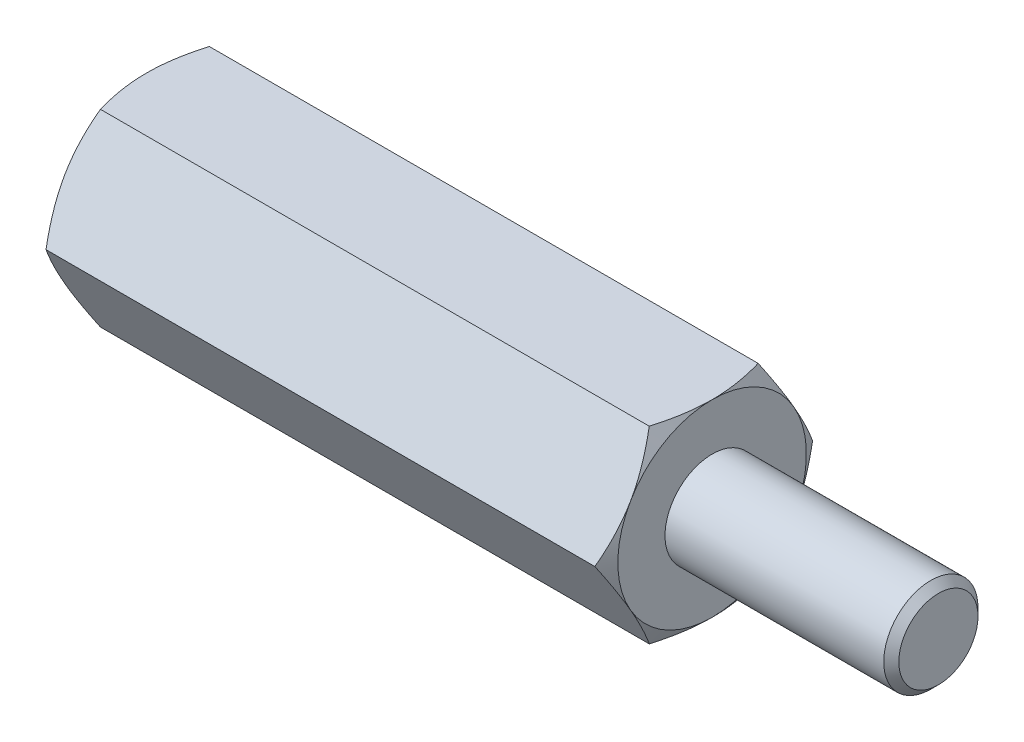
ISO-10303-21;
HEADER;
FILE_DESCRIPTION(('STEP AP214'),'2;1');
FILE_NAME('part.step','',(''),(''),'','','');
FILE_SCHEMA(('AUTOMOTIVE_DESIGN { 1 0 10303 214 1 1 1 1 }'));
ENDSEC;
DATA;
#1=APPLICATION_CONTEXT('core data for automotive mechanical design processes');
#2=APPLICATION_PROTOCOL_DEFINITION('international standard','automotive_design',2000,#1);
#3=PRODUCT_CONTEXT('',#1,'mechanical');
#4=PRODUCT('Part','Part','',(#3));
#5=PRODUCT_RELATED_PRODUCT_CATEGORY('part','',(#4));
#6=PRODUCT_DEFINITION_FORMATION('','',#4);
#7=PRODUCT_DEFINITION_CONTEXT('part definition',#1,'design');
#8=PRODUCT_DEFINITION('design','',#6,#7);
#9=PRODUCT_DEFINITION_SHAPE('','',#8);
#10=(LENGTH_UNIT() NAMED_UNIT(*) SI_UNIT(.MILLI.,.METRE.));
#11=(NAMED_UNIT(*) PLANE_ANGLE_UNIT() SI_UNIT($,.RADIAN.));
#12=(NAMED_UNIT(*) SI_UNIT($,.STERADIAN.) SOLID_ANGLE_UNIT());
#13=UNCERTAINTY_MEASURE_WITH_UNIT(LENGTH_MEASURE(1.E-05),#10,'distance_accuracy_value','');
#14=(GEOMETRIC_REPRESENTATION_CONTEXT(3) GLOBAL_UNCERTAINTY_ASSIGNED_CONTEXT((#13)) GLOBAL_UNIT_ASSIGNED_CONTEXT((#10,
#11,#12)) REPRESENTATION_CONTEXT('',''));
#15=CARTESIAN_POINT('',(0.,0.,0.));
#16=DIRECTION('',(0.,0.,1.));
#17=DIRECTION('',(1.,0.,0.));
#18=AXIS2_PLACEMENT_3D('',#15,#16,#17);
#19=CARTESIAN_POINT('',(7.5,2.5,-1.44337567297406));
#20=DIRECTION('',(1.,0.,0.));
#21=DIRECTION('',(0.,0.,-1.));
#22=AXIS2_PLACEMENT_3D('',#19,#20,#21);
#23=PLANE('',#22);
#24=CARTESIAN_POINT('',(7.5,0.,0.));
#25=DIRECTION('',(1.,0.,0.));
#26=DIRECTION('',(0.,0.,-1.));
#27=AXIS2_PLACEMENT_3D('',#24,#25,#26);
#28=CIRCLE('',#27,2.5);
#29=CARTESIAN_POINT('',(7.5,-1.25,-2.1650635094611));
#30=VERTEX_POINT('',#29);
#31=CARTESIAN_POINT('',(7.5,1.25,-2.1650635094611));
#32=VERTEX_POINT('',#31);
#33=EDGE_CURVE('E288',#30,#32,#28,.T.);
#34=ORIENTED_EDGE('',*,*,#33,.T.);
#35=CARTESIAN_POINT('',(7.5,2.5,0.));
#36=VERTEX_POINT('',#35);
#37=EDGE_CURVE('E53',#32,#36,#28,.T.);
#38=ORIENTED_EDGE('',*,*,#37,.T.);
#39=CARTESIAN_POINT('',(7.5,1.25,2.1650635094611));
#40=VERTEX_POINT('',#39);
#41=EDGE_CURVE('E297',#36,#40,#28,.T.);
#42=ORIENTED_EDGE('',*,*,#41,.T.);
#43=CARTESIAN_POINT('',(7.5,-1.25,2.1650635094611));
#44=VERTEX_POINT('',#43);
#45=EDGE_CURVE('E302',#40,#44,#28,.T.);
#46=ORIENTED_EDGE('',*,*,#45,.T.);
#47=CARTESIAN_POINT('',(7.5,0.,0.));
#48=DIRECTION('',(-1.,0.,0.));
#49=DIRECTION('',(0.,-1.,0.));
#50=AXIS2_PLACEMENT_3D('',#47,#48,#49);
#51=CIRCLE('',#50,2.5);
#52=CARTESIAN_POINT('',(7.5,-2.5,0.));
#53=VERTEX_POINT('',#52);
#54=EDGE_CURVE('E193',#53,#44,#51,.T.);
#55=ORIENTED_EDGE('',*,*,#54,.F.);
#56=EDGE_CURVE('E61',#53,#30,#28,.T.);
#57=ORIENTED_EDGE('',*,*,#56,.T.);
#58=EDGE_LOOP('',(#34,#38,#42,#46,#55,#57));
#59=FACE_BOUND('',#58,.T.);
#60=CARTESIAN_POINT('',(7.5,0.,0.));
#61=DIRECTION('',(1.,0.,0.));
#62=DIRECTION('',(0.,0.,-1.));
#63=AXIS2_PLACEMENT_3D('',#60,#61,#62);
#64=CIRCLE('',#63,1.25);
#65=CARTESIAN_POINT('',(7.5,0.,-1.25));
#66=VERTEX_POINT('',#65);
#67=EDGE_CURVE('E333',#66,#66,#64,.T.);
#68=ORIENTED_EDGE('',*,*,#67,.F.);
#69=EDGE_LOOP('',(#68));
#70=FACE_BOUND('',#69,.T.);
#71=ADVANCED_FACE('F37',(#59,#70),#23,.T.);
#72=CARTESIAN_POINT('',(7.5,0.,-2.88675134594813));
#73=DIRECTION('',(0.,-0.5,0.866025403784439));
#74=DIRECTION('',(0.,-0.866025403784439,-0.5));
#75=AXIS2_PLACEMENT_3D('',#72,#73,#74);
#76=PLANE('',#75);
#77=CARTESIAN_POINT('',(7.27664233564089,-0.000199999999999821,-2.88686681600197));
#78=CARTESIAN_POINT('',(7.31327837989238,0.109663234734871,-2.82343724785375));
#79=CARTESIAN_POINT('',(7.34659778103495,0.220474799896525,-2.75946016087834));
#80=CARTESIAN_POINT('',(7.40475771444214,0.444016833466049,-2.63039810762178));
#81=CARTESIAN_POINT('',(7.42957767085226,0.556751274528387,-2.5653108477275));
#82=CARTESIAN_POINT('',(7.46821434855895,0.780822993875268,-2.43594298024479));
#83=CARTESIAN_POINT('',(7.48228820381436,0.892125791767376,-2.37168227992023));
#84=CARTESIAN_POINT('',(7.49909084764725,1.11525522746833,-2.24285844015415));
#85=CARTESIAN_POINT('',(7.50183354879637,1.22708105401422,-2.17829576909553));
#86=CARTESIAN_POINT('',(7.49613423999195,1.43604197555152,-2.05765212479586));
#87=CARTESIAN_POINT('',(7.48909160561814,1.53320831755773,-2.0015531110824));
#88=CARTESIAN_POINT('',(7.46676858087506,1.726907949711,-1.88972057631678));
#89=CARTESIAN_POINT('',(7.45148056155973,1.82344056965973,-1.8339874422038));
#90=CARTESIAN_POINT('',(7.41326090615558,2.01753972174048,-1.7219242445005));
#91=CARTESIAN_POINT('',(7.39016722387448,2.11508168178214,-1.66560836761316));
#92=CARTESIAN_POINT('',(7.33775334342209,2.30871060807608,-1.55381665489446));
#93=CARTESIAN_POINT('',(7.30844546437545,2.40480005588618,-1.49833938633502));
#94=CARTESIAN_POINT('',(7.27664233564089,2.5002,-1.44326020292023));
#95=B_SPLINE_CURVE_WITH_KNOTS('',3,(#77,#78,#79,#80,#81,#82,#83,#84,#85,#86,#87,#88,#89,#90,#91,
#92,#93,#94),.UNSPECIFIED.,.F.,.F.,(4,2,2,2,2,2,2,2,4),(0.,0.396285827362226,0.79352433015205,
1.18093086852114,1.56786160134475,1.90479741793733,2.24204551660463,2.58677531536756,
2.93082800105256),.UNSPECIFIED.);
#96=CARTESIAN_POINT('',(7.2767090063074,0.,-2.88675134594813));
#97=VERTEX_POINT('',#96);
#98=EDGE_CURVE('E323',#97,#32,#95,.T.);
#99=ORIENTED_EDGE('',*,*,#98,.F.);
#100=DIRECTION('',(-1.,0.,0.));
#101=VECTOR('',#100,1.);
#102=CARTESIAN_POINT('',(7.5,0.,-2.88675134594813));
#103=LINE('',#102,#101);
#104=CARTESIAN_POINT('',(-7.2767090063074,0.,-2.88675134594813));
#105=VERTEX_POINT('',#104);
#106=EDGE_CURVE('E264',#97,#105,#103,.T.);
#107=ORIENTED_EDGE('',*,*,#106,.T.);
#108=CARTESIAN_POINT('',(-7.27664233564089,2.5002,-1.44326020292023));
#109=CARTESIAN_POINT('',(-7.31327837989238,2.39033676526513,-1.50668977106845));
#110=CARTESIAN_POINT('',(-7.34659778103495,2.27952520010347,-1.57066685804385));
#111=CARTESIAN_POINT('',(-7.40475771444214,2.05598316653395,-1.69972891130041));
#112=CARTESIAN_POINT('',(-7.42957767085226,1.94324872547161,-1.7648161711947));
#113=CARTESIAN_POINT('',(-7.46821434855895,1.71917700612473,-1.8941840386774));
#114=CARTESIAN_POINT('',(-7.48228820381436,1.60787420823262,-1.95844473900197));
#115=CARTESIAN_POINT('',(-7.49909084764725,1.38474477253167,-2.08726857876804));
#116=CARTESIAN_POINT('',(-7.50183354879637,1.27291894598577,-2.15183124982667));
#117=CARTESIAN_POINT('',(-7.49613423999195,1.06395802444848,-2.27247489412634));
#118=CARTESIAN_POINT('',(-7.48909160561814,0.96679168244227,-2.32857390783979));
#119=CARTESIAN_POINT('',(-7.46676858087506,0.773092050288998,-2.44040644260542));
#120=CARTESIAN_POINT('',(-7.45148056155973,0.676559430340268,-2.49613957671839));
#121=CARTESIAN_POINT('',(-7.41326090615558,0.482460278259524,-2.60820277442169));
#122=CARTESIAN_POINT('',(-7.39016722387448,0.38491831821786,-2.66451865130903));
#123=CARTESIAN_POINT('',(-7.33775334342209,0.191289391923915,-2.77631036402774));
#124=CARTESIAN_POINT('',(-7.30844546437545,0.0951999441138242,-2.83178763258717));
#125=CARTESIAN_POINT('',(-7.27664233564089,-0.000199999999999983,-2.88686681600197));
#126=B_SPLINE_CURVE_WITH_KNOTS('',3,(#108,#109,#110,#111,#112,#113,#114,#115,#116,#117,#118,
#119,#120,#121,#122,#123,#124,#125),.UNSPECIFIED.,.F.,.F.,(4,2,2,2,2,2,2,2,4),(0.,
0.396285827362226,0.79352433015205,1.18093086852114,1.56786160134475,1.90479741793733,
2.24204551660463,2.58677531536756,2.93082800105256),.UNSPECIFIED.);
#127=CARTESIAN_POINT('',(-7.5,1.25,-2.1650635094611));
#128=VERTEX_POINT('',#127);
#129=EDGE_CURVE('E357',#128,#105,#126,.T.);
#130=ORIENTED_EDGE('',*,*,#129,.F.);
#131=CARTESIAN_POINT('',(-7.2767090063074,2.5,-1.44337567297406));
#132=VERTEX_POINT('',#131);
#133=EDGE_CURVE('E362',#132,#128,#126,.T.);
#134=ORIENTED_EDGE('',*,*,#133,.F.);
#135=DIRECTION('',(-1.,0.,0.));
#136=VECTOR('',#135,1.);
#137=CARTESIAN_POINT('',(7.5,2.5,-1.44337567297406));
#138=LINE('',#137,#136);
#139=CARTESIAN_POINT('',(7.27670900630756,2.5,-1.44337567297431));
#140=VERTEX_POINT('',#139);
#141=EDGE_CURVE('E279',#140,#132,#138,.T.);
#142=ORIENTED_EDGE('',*,*,#141,.F.);
#143=EDGE_CURVE('E229',#32,#140,#95,.T.);
#144=ORIENTED_EDGE('',*,*,#143,.F.);
#145=EDGE_LOOP('',(#99,#107,#130,#134,#142,#144));
#146=FACE_BOUND('',#145,.T.);
#147=ADVANCED_FACE('F148',(#146),#76,.F.);
#148=CARTESIAN_POINT('',(7.5,2.5,-1.44337567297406));
#149=DIRECTION('',(0.,-1.,0.));
#150=DIRECTION('',(0.,0.,-1.));
#151=AXIS2_PLACEMENT_3D('',#148,#149,#150);
#152=PLANE('',#151);
#153=CARTESIAN_POINT('',(6.26803388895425,2.5,-3.90158441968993));
#154=CARTESIAN_POINT('',(6.32120772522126,2.5,-3.79217004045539));
#155=CARTESIAN_POINT('',(6.37387869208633,2.5,-3.68250707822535));
#156=CARTESIAN_POINT('',(6.47793249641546,2.5,-3.46255185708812));
#157=CARTESIAN_POINT('',(6.52931513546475,2.5,-3.35225950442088));
#158=CARTESIAN_POINT('',(6.63076309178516,2.5,-3.130356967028));
#159=CARTESIAN_POINT('',(6.68081992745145,2.5,-3.01874289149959));
#160=CARTESIAN_POINT('',(6.77891712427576,2.5,-2.79463535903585));
#161=CARTESIAN_POINT('',(6.82695757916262,2.5,-2.68214194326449));
#162=CARTESIAN_POINT('',(6.92201845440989,2.5,-2.45240385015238));
#163=CARTESIAN_POINT('',(6.96895431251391,2.5,-2.33512399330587));
#164=CARTESIAN_POINT('',(7.05933269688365,2.5,-2.09920133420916));
#165=CARTESIAN_POINT('',(7.10277483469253,2.5,-1.98055838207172));
#166=CARTESIAN_POINT('',(7.18504351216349,2.5,-1.74193489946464));
#167=CARTESIAN_POINT('',(7.22387917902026,2.5,-1.6219575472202));
#168=CARTESIAN_POINT('',(7.29570507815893,2.5,-1.38028205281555));
#169=CARTESIAN_POINT('',(7.32869712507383,2.5,-1.25858445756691));
#170=CARTESIAN_POINT('',(7.38709594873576,2.5,-1.01406369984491));
#171=CARTESIAN_POINT('',(7.41254379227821,2.5,-0.891250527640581));
#172=CARTESIAN_POINT('',(7.45442751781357,2.5,-0.64407172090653));
#173=CARTESIAN_POINT('',(7.47086432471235,2.5,-0.519706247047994));
#174=CARTESIAN_POINT('',(7.4932006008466,2.5,-0.271679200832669));
#175=CARTESIAN_POINT('',(7.49923751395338,2.5,-0.148030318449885));
#176=CARTESIAN_POINT('',(7.50062561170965,2.5,0.0993395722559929));
#177=CARTESIAN_POINT('',(7.49597656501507,2.5,0.223060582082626));
#178=CARTESIAN_POINT('',(7.47940443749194,2.5,0.432351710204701));
#179=CARTESIAN_POINT('',(7.47010665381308,2.5,0.518143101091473));
#180=CARTESIAN_POINT('',(7.44693847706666,2.5,0.689112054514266));
#181=CARTESIAN_POINT('',(7.43306748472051,2.5,0.774289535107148));
#182=CARTESIAN_POINT('',(7.38532020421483,2.5,1.02876599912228));
#183=CARTESIAN_POINT('',(7.34531764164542,2.5,1.19691958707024));
#184=CARTESIAN_POINT('',(7.25226567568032,2.5,1.53362893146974));
#185=CARTESIAN_POINT('',(7.19893620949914,2.5,1.70210423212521));
#186=CARTESIAN_POINT('',(7.11237169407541,2.5,1.95247339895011));
#187=CARTESIAN_POINT('',(7.08242477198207,2.5,2.03553184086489));
#188=CARTESIAN_POINT('',(7.02068409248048,2.5,2.20095860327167));
#189=CARTESIAN_POINT('',(6.98889037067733,2.5,2.2833269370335));
#190=CARTESIAN_POINT('',(6.90401426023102,2.5,2.49723312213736));
#191=CARTESIAN_POINT('',(6.84971733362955,2.5,2.6282879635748));
#192=CARTESIAN_POINT('',(6.73812739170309,2.5,2.88912034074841));
#193=CARTESIAN_POINT('',(6.6808341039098,2.5,3.01889775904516));
#194=CARTESIAN_POINT('',(6.56393487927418,2.5,3.27745045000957));
#195=CARTESIAN_POINT('',(6.50432825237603,2.5,3.40622540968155));
#196=CARTESIAN_POINT('',(6.38332345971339,2.5,3.66293235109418));
#197=CARTESIAN_POINT('',(6.32192524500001,2.5,3.79086430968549));
#198=CARTESIAN_POINT('',(6.1354580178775,2.5,4.17399495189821));
#199=CARTESIAN_POINT('',(6.00828249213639,2.5,4.42816724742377));
#200=CARTESIAN_POINT('',(5.75034557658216,2.5,4.93461464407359));
#201=CARTESIAN_POINT('',(5.61958483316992,2.5,5.18689007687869));
#202=CARTESIAN_POINT('',(5.36871001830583,2.5,5.66512451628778));
#203=CARTESIAN_POINT('',(5.24882986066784,2.5,5.89120644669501));
#204=CARTESIAN_POINT('',(5.00759021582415,2.5,6.34259369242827));
#205=CARTESIAN_POINT('',(4.88623065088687,2.5,6.56789896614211));
#206=CARTESIAN_POINT('',(4.64278038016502,2.5,7.01722044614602));
#207=CARTESIAN_POINT('',(4.52069305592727,2.5,7.24123848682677));
#208=CARTESIAN_POINT('',(4.27566624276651,2.5,7.68878772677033));
#209=CARTESIAN_POINT('',(4.15272681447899,2.5,7.9123189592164));
#210=CARTESIAN_POINT('',(4.02947566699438,2.5,8.13567697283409));
#211=B_SPLINE_CURVE_WITH_KNOTS('',3,(#153,#154,#155,#156,#157,#158,#159,#160,#161,#162,#163,
#164,#165,#166,#167,#168,#169,#170,#171,#172,#173,#174,#175,#176,#177,#178,#179,#180,#181,#182,
#183,#184,#185,#186,#187,#188,#189,#190,#191,#192,#193,#194,#195,#196,#197,#198,#199,#200,#201,
#202,#203,#204,#205,#206,#207,#208,#209,#210),.UNSPECIFIED.,.F.,.F.,(4,2,2,2,2,2,2,2,2,2,2,2,2,
2,2,2,2,2,2,2,2,2,2,2,2,2,2,2,4),(0.,0.364957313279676,0.729970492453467,1.09692930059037,
1.46387103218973,1.84279746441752,2.22176597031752,2.59997058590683,2.97805755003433,
3.35404692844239,3.72999770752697,4.10094071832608,4.47189175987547,4.73064905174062,
4.98944026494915,5.5072907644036,6.03710483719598,6.30196454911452,6.56681915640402,
6.99233818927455,7.41789598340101,7.84358170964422,8.26927907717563,9.12186602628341,
9.9743002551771,10.7419897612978,11.5097197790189,12.2750964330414,13.0404191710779),.UNSPECIFIED.);
#212=EDGE_CURVE('E227',#140,#36,#211,.T.);
#213=ORIENTED_EDGE('',*,*,#212,.F.);
#214=ORIENTED_EDGE('',*,*,#141,.T.);
#215=CARTESIAN_POINT('',(-6.26803388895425,2.5,-3.90158441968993));
#216=CARTESIAN_POINT('',(-6.32120772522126,2.5,-3.79217004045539));
#217=CARTESIAN_POINT('',(-6.37387869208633,2.5,-3.68250707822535));
#218=CARTESIAN_POINT('',(-6.47793249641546,2.5,-3.46255185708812));
#219=CARTESIAN_POINT('',(-6.52931513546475,2.5,-3.35225950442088));
#220=CARTESIAN_POINT('',(-6.63076309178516,2.5,-3.130356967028));
#221=CARTESIAN_POINT('',(-6.68081992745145,2.5,-3.01874289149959));
#222=CARTESIAN_POINT('',(-6.77891712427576,2.5,-2.79463535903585));
#223=CARTESIAN_POINT('',(-6.82695757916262,2.5,-2.68214194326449));
#224=CARTESIAN_POINT('',(-6.92201845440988,2.5,-2.45240385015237));
#225=CARTESIAN_POINT('',(-6.96895431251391,2.5,-2.33512399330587));
#226=CARTESIAN_POINT('',(-7.05933269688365,2.5,-2.09920133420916));
#227=CARTESIAN_POINT('',(-7.10277483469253,2.5,-1.98055838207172));
#228=CARTESIAN_POINT('',(-7.18504351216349,2.5,-1.74193489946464));
#229=CARTESIAN_POINT('',(-7.22387917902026,2.5,-1.6219575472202));
#230=CARTESIAN_POINT('',(-7.29570507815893,2.5,-1.38028205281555));
#231=CARTESIAN_POINT('',(-7.32869712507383,2.5,-1.25858445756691));
#232=CARTESIAN_POINT('',(-7.38709594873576,2.5,-1.01406369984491));
#233=CARTESIAN_POINT('',(-7.41254379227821,2.5,-0.891250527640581));
#234=CARTESIAN_POINT('',(-7.45442751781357,2.5,-0.64407172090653));
#235=CARTESIAN_POINT('',(-7.47086432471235,2.5,-0.519706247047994));
#236=CARTESIAN_POINT('',(-7.4932006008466,2.5,-0.271679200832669));
#237=CARTESIAN_POINT('',(-7.49923751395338,2.5,-0.148030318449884));
#238=CARTESIAN_POINT('',(-7.50062561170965,2.5,0.0993395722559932));
#239=CARTESIAN_POINT('',(-7.49597656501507,2.5,0.223060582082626));
#240=CARTESIAN_POINT('',(-7.47940443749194,2.5,0.432351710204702));
#241=CARTESIAN_POINT('',(-7.47010665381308,2.5,0.518143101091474));
#242=CARTESIAN_POINT('',(-7.44693847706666,2.5,0.689112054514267));
#243=CARTESIAN_POINT('',(-7.43306748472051,2.5,0.774289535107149));
#244=CARTESIAN_POINT('',(-7.38532020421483,2.5,1.02876599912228));
#245=CARTESIAN_POINT('',(-7.34531764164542,2.5,1.19691958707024));
#246=CARTESIAN_POINT('',(-7.25226567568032,2.5,1.53362893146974));
#247=CARTESIAN_POINT('',(-7.19893620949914,2.5,1.70210423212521));
#248=CARTESIAN_POINT('',(-7.11237169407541,2.5,1.95247339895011));
#249=CARTESIAN_POINT('',(-7.08242477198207,2.5,2.03553184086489));
#250=CARTESIAN_POINT('',(-7.02068409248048,2.5,2.20095860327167));
#251=CARTESIAN_POINT('',(-6.98889037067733,2.5,2.2833269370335));
#252=CARTESIAN_POINT('',(-6.90401426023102,2.5,2.49723312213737));
#253=CARTESIAN_POINT('',(-6.84971733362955,2.5,2.6282879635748));
#254=CARTESIAN_POINT('',(-6.73812739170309,2.5,2.88912034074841));
#255=CARTESIAN_POINT('',(-6.6808341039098,2.5,3.01889775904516));
#256=CARTESIAN_POINT('',(-6.56393487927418,2.5,3.27745045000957));
#257=CARTESIAN_POINT('',(-6.50432825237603,2.5,3.40622540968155));
#258=CARTESIAN_POINT('',(-6.38332345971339,2.5,3.66293235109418));
#259=CARTESIAN_POINT('',(-6.32192524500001,2.5,3.79086430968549));
#260=CARTESIAN_POINT('',(-6.1354580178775,2.5,4.17399495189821));
#261=CARTESIAN_POINT('',(-6.00828249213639,2.5,4.42816724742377));
#262=CARTESIAN_POINT('',(-5.75034557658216,2.5,4.93461464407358));
#263=CARTESIAN_POINT('',(-5.61958483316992,2.5,5.18689007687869));
#264=CARTESIAN_POINT('',(-5.36871001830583,2.5,5.66512451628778));
#265=CARTESIAN_POINT('',(-5.24882986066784,2.5,5.89120644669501));
#266=CARTESIAN_POINT('',(-5.00759021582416,2.5,6.34259369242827));
#267=CARTESIAN_POINT('',(-4.88623065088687,2.5,6.5678989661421));
#268=CARTESIAN_POINT('',(-4.64278038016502,2.5,7.01722044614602));
#269=CARTESIAN_POINT('',(-4.52069305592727,2.5,7.24123848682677));
#270=CARTESIAN_POINT('',(-4.27566624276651,2.5,7.68878772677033));
#271=CARTESIAN_POINT('',(-4.15272681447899,2.5,7.9123189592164));
#272=CARTESIAN_POINT('',(-4.02947566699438,2.5,8.13567697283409));
#273=B_SPLINE_CURVE_WITH_KNOTS('',3,(#215,#216,#217,#218,#219,#220,#221,#222,#223,#224,#225,
#226,#227,#228,#229,#230,#231,#232,#233,#234,#235,#236,#237,#238,#239,#240,#241,#242,#243,#244,
#245,#246,#247,#248,#249,#250,#251,#252,#253,#254,#255,#256,#257,#258,#259,#260,#261,#262,#263,
#264,#265,#266,#267,#268,#269,#270,#271,#272),.UNSPECIFIED.,.F.,.F.,(4,2,2,2,2,2,2,2,2,2,2,2,2,
2,2,2,2,2,2,2,2,2,2,2,2,2,2,2,4),(0.,0.364957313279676,0.729970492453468,1.09692930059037,
1.46387103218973,1.84279746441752,2.22176597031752,2.59997058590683,2.97805755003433,
3.35404692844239,3.72999770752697,4.10094071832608,4.47189175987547,4.73064905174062,
4.98944026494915,5.5072907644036,6.03710483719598,6.30196454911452,6.56681915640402,
6.99233818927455,7.41789598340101,7.84358170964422,8.26927907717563,9.12186602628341,
9.97430025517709,10.7419897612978,11.5097197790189,12.2750964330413,13.0404191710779),.UNSPECIFIED.);
#274=CARTESIAN_POINT('',(-7.5,2.5,0.));
#275=VERTEX_POINT('',#274);
#276=EDGE_CURVE('E241',#275,#132,#273,.F.);
#277=ORIENTED_EDGE('',*,*,#276,.F.);
#278=CARTESIAN_POINT('',(-7.2767090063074,2.5,1.44337567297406));
#279=VERTEX_POINT('',#278);
#280=EDGE_CURVE('E249',#279,#275,#273,.F.);
#281=ORIENTED_EDGE('',*,*,#280,.F.);
#282=DIRECTION('',(-1.,0.,0.));
#283=VECTOR('',#282,1.);
#284=CARTESIAN_POINT('',(7.5,2.5,1.44337567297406));
#285=LINE('',#284,#283);
#286=CARTESIAN_POINT('',(7.2767090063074,2.5,1.44337567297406));
#287=VERTEX_POINT('',#286);
#288=EDGE_CURVE('E276',#287,#279,#285,.T.);
#289=ORIENTED_EDGE('',*,*,#288,.F.);
#290=EDGE_CURVE('E221',#36,#287,#211,.T.);
#291=ORIENTED_EDGE('',*,*,#290,.F.);
#292=EDGE_LOOP('',(#213,#214,#277,#281,#289,#291));
#293=FACE_BOUND('',#292,.T.);
#294=ADVANCED_FACE('F153',(#293),#152,.F.);
#295=CARTESIAN_POINT('',(7.5,2.5,1.44337567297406));
#296=DIRECTION('',(0.,-0.5,-0.866025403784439));
#297=DIRECTION('',(0.,0.866025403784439,-0.5));
#298=AXIS2_PLACEMENT_3D('',#295,#296,#297);
#299=PLANE('',#298);
#300=CARTESIAN_POINT('',(7.27664233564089,2.5002,1.44326020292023));
#301=CARTESIAN_POINT('',(7.31327837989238,2.39033676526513,1.50668977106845));
#302=CARTESIAN_POINT('',(7.34659778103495,2.27952520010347,1.57066685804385));
#303=CARTESIAN_POINT('',(7.40475771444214,2.05598316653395,1.69972891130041));
#304=CARTESIAN_POINT('',(7.42957767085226,1.94324872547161,1.7648161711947));
#305=CARTESIAN_POINT('',(7.46821434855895,1.71917700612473,1.8941840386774));
#306=CARTESIAN_POINT('',(7.48228820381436,1.60787420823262,1.95844473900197));
#307=CARTESIAN_POINT('',(7.49909084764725,1.38474477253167,2.08726857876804));
#308=CARTESIAN_POINT('',(7.50183354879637,1.27291894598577,2.15183124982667));
#309=CARTESIAN_POINT('',(7.49613423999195,1.06395802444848,2.27247489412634));
#310=CARTESIAN_POINT('',(7.48909160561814,0.96679168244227,2.32857390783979));
#311=CARTESIAN_POINT('',(7.46676858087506,0.773092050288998,2.44040644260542));
#312=CARTESIAN_POINT('',(7.45148056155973,0.676559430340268,2.49613957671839));
#313=CARTESIAN_POINT('',(7.41326090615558,0.482460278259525,2.60820277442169));
#314=CARTESIAN_POINT('',(7.39016722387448,0.38491831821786,2.66451865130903));
#315=CARTESIAN_POINT('',(7.33775334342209,0.191289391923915,2.77631036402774));
#316=CARTESIAN_POINT('',(7.30844546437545,0.0951999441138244,2.83178763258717));
#317=CARTESIAN_POINT('',(7.27664233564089,-0.000199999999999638,2.88686681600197));
#318=B_SPLINE_CURVE_WITH_KNOTS('',3,(#300,#301,#302,#303,#304,#305,#306,#307,#308,#309,#310,
#311,#312,#313,#314,#315,#316,#317),.UNSPECIFIED.,.F.,.F.,(4,2,2,2,2,2,2,2,4),(0.,
0.396285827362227,0.79352433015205,1.18093086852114,1.56786160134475,1.90479741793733,
2.24204551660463,2.58677531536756,2.93082800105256),.UNSPECIFIED.);
#319=EDGE_CURVE('E228',#287,#40,#318,.T.);
#320=ORIENTED_EDGE('',*,*,#319,.F.);
#321=ORIENTED_EDGE('',*,*,#288,.T.);
#322=CARTESIAN_POINT('',(-7.27664233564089,-0.000199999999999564,2.88686681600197));
#323=CARTESIAN_POINT('',(-7.31327837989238,0.109663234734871,2.82343724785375));
#324=CARTESIAN_POINT('',(-7.34659778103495,0.220474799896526,2.75946016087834));
#325=CARTESIAN_POINT('',(-7.40475771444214,0.44401683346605,2.63039810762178));
#326=CARTESIAN_POINT('',(-7.42957767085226,0.556751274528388,2.5653108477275));
#327=CARTESIAN_POINT('',(-7.46821434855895,0.780822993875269,2.43594298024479));
#328=CARTESIAN_POINT('',(-7.48228820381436,0.892125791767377,2.37168227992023));
#329=CARTESIAN_POINT('',(-7.49909084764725,1.11525522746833,2.24285844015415));
#330=CARTESIAN_POINT('',(-7.50183354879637,1.22708105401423,2.17829576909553));
#331=CARTESIAN_POINT('',(-7.49613423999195,1.43604197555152,2.05765212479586));
#332=CARTESIAN_POINT('',(-7.48909160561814,1.53320831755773,2.0015531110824));
#333=CARTESIAN_POINT('',(-7.46676858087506,1.726907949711,1.88972057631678));
#334=CARTESIAN_POINT('',(-7.45148056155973,1.82344056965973,1.8339874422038));
#335=CARTESIAN_POINT('',(-7.41326090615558,2.01753972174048,1.7219242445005));
#336=CARTESIAN_POINT('',(-7.39016722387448,2.11508168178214,1.66560836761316));
#337=CARTESIAN_POINT('',(-7.33775334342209,2.30871060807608,1.55381665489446));
#338=CARTESIAN_POINT('',(-7.30844546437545,2.40480005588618,1.49833938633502));
#339=CARTESIAN_POINT('',(-7.27664233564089,2.5002,1.44326020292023));
#340=B_SPLINE_CURVE_WITH_KNOTS('',3,(#322,#323,#324,#325,#326,#327,#328,#329,#330,#331,#332,
#333,#334,#335,#336,#337,#338,#339),.UNSPECIFIED.,.F.,.F.,(4,2,2,2,2,2,2,2,4),(0.,
0.396285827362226,0.79352433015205,1.18093086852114,1.56786160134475,1.90479741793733,
2.24204551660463,2.58677531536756,2.93082800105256),.UNSPECIFIED.);
#341=CARTESIAN_POINT('',(-7.5,1.25,2.1650635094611));
#342=VERTEX_POINT('',#341);
#343=EDGE_CURVE('E255',#342,#279,#340,.T.);
#344=ORIENTED_EDGE('',*,*,#343,.F.);
#345=CARTESIAN_POINT('',(-7.2767090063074,0.,2.88675134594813));
#346=VERTEX_POINT('',#345);
#347=EDGE_CURVE('E262',#346,#342,#340,.T.);
#348=ORIENTED_EDGE('',*,*,#347,.F.);
#349=DIRECTION('',(-1.,0.,0.));
#350=VECTOR('',#349,1.);
#351=CARTESIAN_POINT('',(7.5,0.,2.88675134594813));
#352=LINE('',#351,#350);
#353=CARTESIAN_POINT('',(7.2767090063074,0.,2.88675134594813));
#354=VERTEX_POINT('',#353);
#355=EDGE_CURVE('E273',#354,#346,#352,.T.);
#356=ORIENTED_EDGE('',*,*,#355,.F.);
#357=EDGE_CURVE('E215',#40,#354,#318,.T.);
#358=ORIENTED_EDGE('',*,*,#357,.F.);
#359=EDGE_LOOP('',(#320,#321,#344,#348,#356,#358));
#360=FACE_BOUND('',#359,.T.);
#361=ADVANCED_FACE('F235',(#360),#299,.F.);
#362=CARTESIAN_POINT('',(7.5,0.,2.88675134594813));
#363=DIRECTION('',(0.,0.5,-0.866025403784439));
#364=DIRECTION('',(0.,0.866025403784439,0.5));
#365=AXIS2_PLACEMENT_3D('',#362,#363,#364);
#366=PLANE('',#365);
#367=CARTESIAN_POINT('',(7.27664233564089,0.000200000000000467,2.88686681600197));
#368=CARTESIAN_POINT('',(7.31327837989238,-0.109663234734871,2.82343724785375));
#369=CARTESIAN_POINT('',(7.34659778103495,-0.220474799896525,2.75946016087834));
#370=CARTESIAN_POINT('',(7.40475771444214,-0.444016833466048,2.63039810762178));
#371=CARTESIAN_POINT('',(7.42957767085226,-0.556751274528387,2.5653108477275));
#372=CARTESIAN_POINT('',(7.46821434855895,-0.780822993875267,2.43594298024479));
#373=CARTESIAN_POINT('',(7.48228820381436,-0.892125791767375,2.37168227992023));
#374=CARTESIAN_POINT('',(7.49909084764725,-1.11525522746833,2.24285844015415));
#375=CARTESIAN_POINT('',(7.50183354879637,-1.22708105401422,2.17829576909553));
#376=CARTESIAN_POINT('',(7.49613423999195,-1.43604197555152,2.05765212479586));
#377=CARTESIAN_POINT('',(7.48909160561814,-1.53320831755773,2.0015531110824));
#378=CARTESIAN_POINT('',(7.46676858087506,-1.726907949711,1.88972057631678));
#379=CARTESIAN_POINT('',(7.45148056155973,-1.82344056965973,1.8339874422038));
#380=CARTESIAN_POINT('',(7.41326090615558,-2.01753972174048,1.7219242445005));
#381=CARTESIAN_POINT('',(7.39016722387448,-2.11508168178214,1.66560836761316));
#382=CARTESIAN_POINT('',(7.33775334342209,-2.30871060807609,1.55381665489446));
#383=CARTESIAN_POINT('',(7.30844546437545,-2.40480005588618,1.49833938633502));
#384=CARTESIAN_POINT('',(7.27664233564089,-2.5002,1.44326020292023));
#385=B_SPLINE_CURVE_WITH_KNOTS('',3,(#367,#368,#369,#370,#371,#372,#373,#374,#375,#376,#377,
#378,#379,#380,#381,#382,#383,#384),.UNSPECIFIED.,.F.,.F.,(4,2,2,2,2,2,2,2,4),(0.,
0.396285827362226,0.793524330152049,1.18093086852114,1.56786160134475,1.90479741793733,
2.24204551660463,2.58677531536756,2.93082800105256),.UNSPECIFIED.);
#386=EDGE_CURVE('E410',#354,#44,#385,.T.);
#387=ORIENTED_EDGE('',*,*,#386,.F.);
#388=ORIENTED_EDGE('',*,*,#355,.T.);
#389=CARTESIAN_POINT('',(-7.27664233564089,-2.5002,1.44326020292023));
#390=CARTESIAN_POINT('',(-7.31327837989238,-2.39033676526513,1.50668977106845));
#391=CARTESIAN_POINT('',(-7.34659778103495,-2.27952520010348,1.57066685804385));
#392=CARTESIAN_POINT('',(-7.40475771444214,-2.05598316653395,1.69972891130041));
#393=CARTESIAN_POINT('',(-7.42957767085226,-1.94324872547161,1.7648161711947));
#394=CARTESIAN_POINT('',(-7.46821434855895,-1.71917700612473,1.8941840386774));
#395=CARTESIAN_POINT('',(-7.48228820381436,-1.60787420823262,1.95844473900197));
#396=CARTESIAN_POINT('',(-7.49909084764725,-1.38474477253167,2.08726857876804));
#397=CARTESIAN_POINT('',(-7.50183354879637,-1.27291894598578,2.15183124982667));
#398=CARTESIAN_POINT('',(-7.49613423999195,-1.06395802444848,2.27247489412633));
#399=CARTESIAN_POINT('',(-7.48909160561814,-0.966791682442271,2.32857390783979));
#400=CARTESIAN_POINT('',(-7.46676858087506,-0.773092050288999,2.44040644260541));
#401=CARTESIAN_POINT('',(-7.45148056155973,-0.676559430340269,2.49613957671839));
#402=CARTESIAN_POINT('',(-7.41326090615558,-0.482460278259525,2.60820277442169));
#403=CARTESIAN_POINT('',(-7.39016722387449,-0.38491831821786,2.66451865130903));
#404=CARTESIAN_POINT('',(-7.33775334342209,-0.191289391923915,2.77631036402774));
#405=CARTESIAN_POINT('',(-7.30844546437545,-0.0951999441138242,2.83178763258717));
#406=CARTESIAN_POINT('',(-7.27664233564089,0.000200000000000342,2.88686681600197));
#407=B_SPLINE_CURVE_WITH_KNOTS('',3,(#389,#390,#391,#392,#393,#394,#395,#396,#397,#398,#399,
#400,#401,#402,#403,#404,#405,#406),.UNSPECIFIED.,.F.,.F.,(4,2,2,2,2,2,2,2,4),(0.,
0.396285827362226,0.793524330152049,1.18093086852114,1.56786160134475,1.90479741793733,
2.24204551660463,2.58677531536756,2.93082800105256),.UNSPECIFIED.);
#408=CARTESIAN_POINT('',(-7.5,-1.25,2.1650635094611));
#409=VERTEX_POINT('',#408);
#410=EDGE_CURVE('E263',#409,#346,#407,.T.);
#411=ORIENTED_EDGE('',*,*,#410,.F.);
#412=CARTESIAN_POINT('',(-7.2767090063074,-2.5,1.44337567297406));
#413=VERTEX_POINT('',#412);
#414=EDGE_CURVE('E250',#413,#409,#407,.T.);
#415=ORIENTED_EDGE('',*,*,#414,.F.);
#416=DIRECTION('',(-1.,0.,0.));
#417=VECTOR('',#416,1.);
#418=CARTESIAN_POINT('',(7.5,-2.5,1.44337567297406));
#419=LINE('',#418,#417);
#420=CARTESIAN_POINT('',(7.2767090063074,-2.5,1.44337567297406));
#421=VERTEX_POINT('',#420);
#422=EDGE_CURVE('E270',#421,#413,#419,.T.);
#423=ORIENTED_EDGE('',*,*,#422,.F.);
#424=EDGE_CURVE('E210',#44,#421,#385,.T.);
#425=ORIENTED_EDGE('',*,*,#424,.F.);
#426=EDGE_LOOP('',(#387,#388,#411,#415,#423,#425));
#427=FACE_BOUND('',#426,.T.);
#428=ADVANCED_FACE('F393',(#427),#366,.F.);
#429=CARTESIAN_POINT('',(7.5,-2.5,1.44337567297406));
#430=DIRECTION('',(0.,1.,0.));
#431=DIRECTION('',(0.,0.,1.));
#432=AXIS2_PLACEMENT_3D('',#429,#430,#431);
#433=PLANE('',#432);
#434=CARTESIAN_POINT('',(6.26803388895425,-2.5,-3.90158441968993));
#435=CARTESIAN_POINT('',(6.32120772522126,-2.5,-3.79217004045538));
#436=CARTESIAN_POINT('',(6.37387869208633,-2.5,-3.68250707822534));
#437=CARTESIAN_POINT('',(6.47793249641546,-2.5,-3.46255185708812));
#438=CARTESIAN_POINT('',(6.52931513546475,-2.5,-3.35225950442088));
#439=CARTESIAN_POINT('',(6.63076309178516,-2.5,-3.130356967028));
#440=CARTESIAN_POINT('',(6.68081992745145,-2.5,-3.01874289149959));
#441=CARTESIAN_POINT('',(6.77891712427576,-2.5,-2.79463535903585));
#442=CARTESIAN_POINT('',(6.82695757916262,-2.5,-2.68214194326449));
#443=CARTESIAN_POINT('',(6.92201845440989,-2.5,-2.45240385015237));
#444=CARTESIAN_POINT('',(6.96895431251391,-2.5,-2.33512399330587));
#445=CARTESIAN_POINT('',(7.05933269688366,-2.5,-2.09920133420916));
#446=CARTESIAN_POINT('',(7.10277483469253,-2.5,-1.98055838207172));
#447=CARTESIAN_POINT('',(7.18504351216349,-2.5,-1.74193489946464));
#448=CARTESIAN_POINT('',(7.22387917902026,-2.5,-1.6219575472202));
#449=CARTESIAN_POINT('',(7.29570507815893,-2.5,-1.38028205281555));
#450=CARTESIAN_POINT('',(7.32869712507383,-2.5,-1.25858445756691));
#451=CARTESIAN_POINT('',(7.38709594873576,-2.5,-1.01406369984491));
#452=CARTESIAN_POINT('',(7.41254379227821,-2.5,-0.891250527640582));
#453=CARTESIAN_POINT('',(7.45442751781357,-2.5,-0.644071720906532));
#454=CARTESIAN_POINT('',(7.47086432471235,-2.5,-0.519706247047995));
#455=CARTESIAN_POINT('',(7.4932006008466,-2.5,-0.27167920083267));
#456=CARTESIAN_POINT('',(7.49923751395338,-2.5,-0.148030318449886));
#457=CARTESIAN_POINT('',(7.50062561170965,-2.5,0.0993395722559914));
#458=CARTESIAN_POINT('',(7.49597656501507,-2.5,0.223060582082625));
#459=CARTESIAN_POINT('',(7.47940443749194,-2.5,0.432351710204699));
#460=CARTESIAN_POINT('',(7.47010665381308,-2.5,0.518143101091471));
#461=CARTESIAN_POINT('',(7.44693847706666,-2.5,0.689112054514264));
#462=CARTESIAN_POINT('',(7.43306748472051,-2.5,0.774289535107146));
#463=CARTESIAN_POINT('',(7.38532020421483,-2.5,1.02876599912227));
#464=CARTESIAN_POINT('',(7.34531764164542,-2.5,1.19691958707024));
#465=CARTESIAN_POINT('',(7.25226567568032,-2.5,1.53362893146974));
#466=CARTESIAN_POINT('',(7.19893620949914,-2.5,1.70210423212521));
#467=CARTESIAN_POINT('',(7.11237169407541,-2.5,1.95247339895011));
#468=CARTESIAN_POINT('',(7.08242477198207,-2.5,2.03553184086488));
#469=CARTESIAN_POINT('',(7.02068409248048,-2.5,2.20095860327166));
#470=CARTESIAN_POINT('',(6.98889037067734,-2.5,2.28332693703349));
#471=CARTESIAN_POINT('',(6.90401426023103,-2.5,2.49723312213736));
#472=CARTESIAN_POINT('',(6.84971733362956,-2.5,2.6282879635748));
#473=CARTESIAN_POINT('',(6.7381273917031,-2.5,2.8891203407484));
#474=CARTESIAN_POINT('',(6.6808341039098,-2.5,3.01889775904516));
#475=CARTESIAN_POINT('',(6.56393487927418,-2.5,3.27745045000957));
#476=CARTESIAN_POINT('',(6.50432825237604,-2.5,3.40622540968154));
#477=CARTESIAN_POINT('',(6.3833234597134,-2.5,3.66293235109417));
#478=CARTESIAN_POINT('',(6.32192524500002,-2.5,3.79086430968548));
#479=CARTESIAN_POINT('',(6.1354580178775,-2.5,4.1739949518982));
#480=CARTESIAN_POINT('',(6.00828249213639,-2.5,4.42816724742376));
#481=CARTESIAN_POINT('',(5.75034557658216,-2.5,4.93461464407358));
#482=CARTESIAN_POINT('',(5.61958483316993,-2.5,5.18689007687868));
#483=CARTESIAN_POINT('',(5.36871001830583,-2.5,5.66512451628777));
#484=CARTESIAN_POINT('',(5.24882986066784,-2.5,5.891206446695));
#485=CARTESIAN_POINT('',(5.00759021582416,-2.5,6.34259369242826));
#486=CARTESIAN_POINT('',(4.88623065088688,-2.5,6.5678989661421));
#487=CARTESIAN_POINT('',(4.64278038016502,-2.5,7.01722044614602));
#488=CARTESIAN_POINT('',(4.52069305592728,-2.5,7.24123848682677));
#489=CARTESIAN_POINT('',(4.27566624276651,-2.5,7.68878772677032));
#490=CARTESIAN_POINT('',(4.15272681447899,-2.5,7.9123189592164));
#491=CARTESIAN_POINT('',(4.02947566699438,-2.5,8.13567697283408));
#492=B_SPLINE_CURVE_WITH_KNOTS('',3,(#434,#435,#436,#437,#438,#439,#440,#441,#442,#443,#444,
#445,#446,#447,#448,#449,#450,#451,#452,#453,#454,#455,#456,#457,#458,#459,#460,#461,#462,#463,
#464,#465,#466,#467,#468,#469,#470,#471,#472,#473,#474,#475,#476,#477,#478,#479,#480,#481,#482,
#483,#484,#485,#486,#487,#488,#489,#490,#491),.UNSPECIFIED.,.F.,.F.,(4,2,2,2,2,2,2,2,2,2,2,2,2,
2,2,2,2,2,2,2,2,2,2,2,2,2,2,2,4),(0.,0.364957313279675,0.729970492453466,1.09692930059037,
1.46387103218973,1.84279746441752,2.22176597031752,2.59997058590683,2.97805755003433,
3.35404692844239,3.72999770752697,4.10094071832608,4.47189175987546,4.73064905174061,
4.98944026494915,5.50729076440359,6.03710483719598,6.30196454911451,6.56681915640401,
6.99233818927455,7.417895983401,7.84358170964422,8.26927907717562,9.1218660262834,
9.97430025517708,10.7419897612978,11.5097197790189,12.2750964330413,13.0404191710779),.UNSPECIFIED.);
#493=EDGE_CURVE('E319',#421,#53,#492,.F.);
#494=ORIENTED_EDGE('',*,*,#493,.F.);
#495=ORIENTED_EDGE('',*,*,#422,.T.);
#496=CARTESIAN_POINT('',(-6.26803388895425,-2.5,-3.90158441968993));
#497=CARTESIAN_POINT('',(-6.32120772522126,-2.5,-3.79217004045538));
#498=CARTESIAN_POINT('',(-6.37387869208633,-2.5,-3.68250707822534));
#499=CARTESIAN_POINT('',(-6.47793249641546,-2.5,-3.46255185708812));
#500=CARTESIAN_POINT('',(-6.52931513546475,-2.5,-3.35225950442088));
#501=CARTESIAN_POINT('',(-6.63076309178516,-2.5,-3.130356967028));
#502=CARTESIAN_POINT('',(-6.68081992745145,-2.5,-3.01874289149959));
#503=CARTESIAN_POINT('',(-6.77891712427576,-2.5,-2.79463535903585));
#504=CARTESIAN_POINT('',(-6.82695757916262,-2.5,-2.68214194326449));
#505=CARTESIAN_POINT('',(-6.92201845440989,-2.5,-2.45240385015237));
#506=CARTESIAN_POINT('',(-6.96895431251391,-2.5,-2.33512399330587));
#507=CARTESIAN_POINT('',(-7.05933269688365,-2.5,-2.09920133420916));
#508=CARTESIAN_POINT('',(-7.10277483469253,-2.5,-1.98055838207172));
#509=CARTESIAN_POINT('',(-7.18504351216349,-2.5,-1.74193489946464));
#510=CARTESIAN_POINT('',(-7.22387917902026,-2.5,-1.6219575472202));
#511=CARTESIAN_POINT('',(-7.29570507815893,-2.5,-1.38028205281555));
#512=CARTESIAN_POINT('',(-7.32869712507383,-2.5,-1.25858445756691));
#513=CARTESIAN_POINT('',(-7.38709594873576,-2.5,-1.01406369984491));
#514=CARTESIAN_POINT('',(-7.41254379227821,-2.5,-0.891250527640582));
#515=CARTESIAN_POINT('',(-7.45442751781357,-2.5,-0.644071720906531));
#516=CARTESIAN_POINT('',(-7.47086432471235,-2.5,-0.519706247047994));
#517=CARTESIAN_POINT('',(-7.4932006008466,-2.5,-0.271679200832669));
#518=CARTESIAN_POINT('',(-7.49923751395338,-2.5,-0.148030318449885));
#519=CARTESIAN_POINT('',(-7.50062561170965,-2.5,0.0993395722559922));
#520=CARTESIAN_POINT('',(-7.49597656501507,-2.5,0.223060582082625));
#521=CARTESIAN_POINT('',(-7.47940443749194,-2.5,0.4323517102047));
#522=CARTESIAN_POINT('',(-7.47010665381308,-2.5,0.518143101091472));
#523=CARTESIAN_POINT('',(-7.44693847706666,-2.5,0.689112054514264));
#524=CARTESIAN_POINT('',(-7.43306748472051,-2.5,0.774289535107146));
#525=CARTESIAN_POINT('',(-7.38532020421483,-2.5,1.02876599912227));
#526=CARTESIAN_POINT('',(-7.34531764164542,-2.5,1.19691958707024));
#527=CARTESIAN_POINT('',(-7.25226567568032,-2.5,1.53362893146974));
#528=CARTESIAN_POINT('',(-7.19893620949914,-2.5,1.70210423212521));
#529=CARTESIAN_POINT('',(-7.11237169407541,-2.5,1.95247339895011));
#530=CARTESIAN_POINT('',(-7.08242477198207,-2.5,2.03553184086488));
#531=CARTESIAN_POINT('',(-7.02068409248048,-2.5,2.20095860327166));
#532=CARTESIAN_POINT('',(-6.98889037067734,-2.5,2.28332693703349));
#533=CARTESIAN_POINT('',(-6.90401426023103,-2.5,2.49723312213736));
#534=CARTESIAN_POINT('',(-6.84971733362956,-2.5,2.6282879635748));
#535=CARTESIAN_POINT('',(-6.7381273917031,-2.5,2.8891203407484));
#536=CARTESIAN_POINT('',(-6.6808341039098,-2.5,3.01889775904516));
#537=CARTESIAN_POINT('',(-6.56393487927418,-2.5,3.27745045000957));
#538=CARTESIAN_POINT('',(-6.50432825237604,-2.5,3.40622540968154));
#539=CARTESIAN_POINT('',(-6.3833234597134,-2.5,3.66293235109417));
#540=CARTESIAN_POINT('',(-6.32192524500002,-2.5,3.79086430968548));
#541=CARTESIAN_POINT('',(-6.1354580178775,-2.5,4.1739949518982));
#542=CARTESIAN_POINT('',(-6.00828249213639,-2.5,4.42816724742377));
#543=CARTESIAN_POINT('',(-5.75034557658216,-2.5,4.93461464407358));
#544=CARTESIAN_POINT('',(-5.61958483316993,-2.5,5.18689007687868));
#545=CARTESIAN_POINT('',(-5.36871001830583,-2.5,5.66512451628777));
#546=CARTESIAN_POINT('',(-5.24882986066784,-2.5,5.891206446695));
#547=CARTESIAN_POINT('',(-5.00759021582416,-2.5,6.34259369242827));
#548=CARTESIAN_POINT('',(-4.88623065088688,-2.5,6.5678989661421));
#549=CARTESIAN_POINT('',(-4.64278038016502,-2.5,7.01722044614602));
#550=CARTESIAN_POINT('',(-4.52069305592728,-2.5,7.24123848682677));
#551=CARTESIAN_POINT('',(-4.27566624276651,-2.5,7.68878772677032));
#552=CARTESIAN_POINT('',(-4.15272681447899,-2.5,7.9123189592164));
#553=CARTESIAN_POINT('',(-4.02947566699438,-2.5,8.13567697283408));
#554=B_SPLINE_CURVE_WITH_KNOTS('',3,(#496,#497,#498,#499,#500,#501,#502,#503,#504,#505,#506,
#507,#508,#509,#510,#511,#512,#513,#514,#515,#516,#517,#518,#519,#520,#521,#522,#523,#524,#525,
#526,#527,#528,#529,#530,#531,#532,#533,#534,#535,#536,#537,#538,#539,#540,#541,#542,#543,#544,
#545,#546,#547,#548,#549,#550,#551,#552,#553),.UNSPECIFIED.,.F.,.F.,(4,2,2,2,2,2,2,2,2,2,2,2,2,
2,2,2,2,2,2,2,2,2,2,2,2,2,2,2,4),(0.,0.364957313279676,0.729970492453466,1.09692930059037,
1.46387103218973,1.84279746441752,2.22176597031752,2.59997058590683,2.97805755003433,
3.35404692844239,3.72999770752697,4.10094071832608,4.47189175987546,4.73064905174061,
4.98944026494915,5.50729076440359,6.03710483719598,6.30196454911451,6.56681915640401,
6.99233818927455,7.417895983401,7.84358170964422,8.26927907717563,9.1218660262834,
9.97430025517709,10.7419897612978,11.5097197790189,12.2750964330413,13.0404191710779),.UNSPECIFIED.);
#555=CARTESIAN_POINT('',(-7.5,-2.5,0.));
#556=VERTEX_POINT('',#555);
#557=EDGE_CURVE('E355',#556,#413,#554,.T.);
#558=ORIENTED_EDGE('',*,*,#557,.F.);
#559=CARTESIAN_POINT('',(-7.2767090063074,-2.5,-1.44337567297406));
#560=VERTEX_POINT('',#559);
#561=EDGE_CURVE('E338',#560,#556,#554,.T.);
#562=ORIENTED_EDGE('',*,*,#561,.F.);
#563=DIRECTION('',(-1.,0.,0.));
#564=VECTOR('',#563,1.);
#565=CARTESIAN_POINT('',(7.5,-2.5,-1.44337567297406));
#566=LINE('',#565,#564);
#567=CARTESIAN_POINT('',(7.2767090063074,-2.5,-1.44337567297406));
#568=VERTEX_POINT('',#567);
#569=EDGE_CURVE('E267',#568,#560,#566,.T.);
#570=ORIENTED_EDGE('',*,*,#569,.F.);
#571=EDGE_CURVE('E195',#53,#568,#492,.F.);
#572=ORIENTED_EDGE('',*,*,#571,.F.);
#573=EDGE_LOOP('',(#494,#495,#558,#562,#570,#572));
#574=FACE_BOUND('',#573,.T.);
#575=ADVANCED_FACE('F172',(#574),#433,.F.);
#576=CARTESIAN_POINT('',(7.5,-2.5,-1.44337567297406));
#577=DIRECTION('',(0.,0.5,0.866025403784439));
#578=DIRECTION('',(0.,-0.866025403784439,0.5));
#579=AXIS2_PLACEMENT_3D('',#576,#577,#578);
#580=PLANE('',#579);
#581=CARTESIAN_POINT('',(7.27664233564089,-2.5002,-1.44326020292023));
#582=CARTESIAN_POINT('',(7.31327837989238,-2.39033676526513,-1.50668977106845));
#583=CARTESIAN_POINT('',(7.34659778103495,-2.27952520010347,-1.57066685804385));
#584=CARTESIAN_POINT('',(7.40475771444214,-2.05598316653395,-1.69972891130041));
#585=CARTESIAN_POINT('',(7.42957767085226,-1.94324872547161,-1.7648161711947));
#586=CARTESIAN_POINT('',(7.46821434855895,-1.71917700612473,-1.8941840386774));
#587=CARTESIAN_POINT('',(7.48228820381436,-1.60787420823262,-1.95844473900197));
#588=CARTESIAN_POINT('',(7.49909084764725,-1.38474477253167,-2.08726857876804));
#589=CARTESIAN_POINT('',(7.50183354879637,-1.27291894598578,-2.15183124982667));
#590=CARTESIAN_POINT('',(7.49613423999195,-1.06395802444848,-2.27247489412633));
#591=CARTESIAN_POINT('',(7.48909160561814,-0.966791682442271,-2.32857390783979));
#592=CARTESIAN_POINT('',(7.46676858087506,-0.773092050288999,-2.44040644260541));
#593=CARTESIAN_POINT('',(7.45148056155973,-0.676559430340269,-2.49613957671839));
#594=CARTESIAN_POINT('',(7.41326090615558,-0.482460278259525,-2.60820277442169));
#595=CARTESIAN_POINT('',(7.39016722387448,-0.38491831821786,-2.66451865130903));
#596=CARTESIAN_POINT('',(7.33775334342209,-0.191289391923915,-2.77631036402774));
#597=CARTESIAN_POINT('',(7.30844546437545,-0.095199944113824,-2.83178763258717));
#598=CARTESIAN_POINT('',(7.27664233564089,0.000200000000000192,-2.88686681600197));
#599=B_SPLINE_CURVE_WITH_KNOTS('',3,(#581,#582,#583,#584,#585,#586,#587,#588,#589,#590,#591,
#592,#593,#594,#595,#596,#597,#598),.UNSPECIFIED.,.F.,.F.,(4,2,2,2,2,2,2,2,4),(0.,
0.396285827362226,0.793524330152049,1.18093086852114,1.56786160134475,1.90479741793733,
2.24204551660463,2.58677531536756,2.93082800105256),.UNSPECIFIED.);
#600=EDGE_CURVE('E192',#568,#30,#599,.T.);
#601=ORIENTED_EDGE('',*,*,#600,.F.);
#602=ORIENTED_EDGE('',*,*,#569,.T.);
#603=CARTESIAN_POINT('',(-7.27664233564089,0.000200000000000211,-2.88686681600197));
#604=CARTESIAN_POINT('',(-7.31327837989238,-0.109663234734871,-2.82343724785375));
#605=CARTESIAN_POINT('',(-7.34659778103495,-0.220474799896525,-2.75946016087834));
#606=CARTESIAN_POINT('',(-7.40475771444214,-0.444016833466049,-2.63039810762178));
#607=CARTESIAN_POINT('',(-7.42957767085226,-0.556751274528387,-2.5653108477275));
#608=CARTESIAN_POINT('',(-7.46821434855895,-0.780822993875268,-2.43594298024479));
#609=CARTESIAN_POINT('',(-7.48228820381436,-0.892125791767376,-2.37168227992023));
#610=CARTESIAN_POINT('',(-7.49909084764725,-1.11525522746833,-2.24285844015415));
#611=CARTESIAN_POINT('',(-7.50183354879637,-1.22708105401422,-2.17829576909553));
#612=CARTESIAN_POINT('',(-7.49613423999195,-1.43604197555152,-2.05765212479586));
#613=CARTESIAN_POINT('',(-7.48909160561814,-1.53320831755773,-2.0015531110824));
#614=CARTESIAN_POINT('',(-7.46676858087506,-1.726907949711,-1.88972057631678));
#615=CARTESIAN_POINT('',(-7.45148056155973,-1.82344056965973,-1.8339874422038));
#616=CARTESIAN_POINT('',(-7.41326090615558,-2.01753972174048,-1.7219242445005));
#617=CARTESIAN_POINT('',(-7.39016722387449,-2.11508168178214,-1.66560836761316));
#618=CARTESIAN_POINT('',(-7.33775334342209,-2.30871060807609,-1.55381665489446));
#619=CARTESIAN_POINT('',(-7.30844546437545,-2.40480005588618,-1.49833938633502));
#620=CARTESIAN_POINT('',(-7.27664233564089,-2.5002,-1.44326020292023));
#621=B_SPLINE_CURVE_WITH_KNOTS('',3,(#603,#604,#605,#606,#607,#608,#609,#610,#611,#612,#613,
#614,#615,#616,#617,#618,#619,#620),.UNSPECIFIED.,.F.,.F.,(4,2,2,2,2,2,2,2,4),(0.,
0.396285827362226,0.79352433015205,1.18093086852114,1.56786160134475,1.90479741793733,
2.24204551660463,2.58677531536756,2.93082800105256),.UNSPECIFIED.);
#622=CARTESIAN_POINT('',(-7.5,-1.25,-2.1650635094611));
#623=VERTEX_POINT('',#622);
#624=EDGE_CURVE('E178',#623,#560,#621,.T.);
#625=ORIENTED_EDGE('',*,*,#624,.F.);
#626=EDGE_CURVE('E336',#105,#623,#621,.T.);
#627=ORIENTED_EDGE('',*,*,#626,.F.);
#628=ORIENTED_EDGE('',*,*,#106,.F.);
#629=EDGE_CURVE('E185',#30,#97,#599,.T.);
#630=ORIENTED_EDGE('',*,*,#629,.F.);
#631=EDGE_LOOP('',(#601,#602,#625,#627,#628,#630));
#632=FACE_BOUND('',#631,.T.);
#633=ADVANCED_FACE('F167',(#632),#580,.F.);
#634=CARTESIAN_POINT('',(-7.5,0.,0.));
#635=DIRECTION('',(1.,0.,0.));
#636=DIRECTION('',(0.,1.,0.));
#637=AXIS2_PLACEMENT_3D('',#634,#635,#636);
#638=CONICAL_SURFACE('',#637,2.5,1.0471975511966);
#639=ORIENTED_EDGE('',*,*,#129,.T.);
#640=ORIENTED_EDGE('',*,*,#626,.T.);
#641=CARTESIAN_POINT('',(-7.5,0.,0.));
#642=DIRECTION('',(1.,0.,0.));
#643=DIRECTION('',(0.,0.,-1.));
#644=AXIS2_PLACEMENT_3D('',#641,#642,#643);
#645=CIRCLE('',#644,2.5);
#646=EDGE_CURVE('E282',#623,#128,#645,.T.);
#647=ORIENTED_EDGE('',*,*,#646,.T.);
#648=EDGE_LOOP('',(#639,#640,#647));
#649=FACE_BOUND('',#648,.T.);
#650=ADVANCED_FACE('F171',(#649),#638,.T.);
#651=ORIENTED_EDGE('',*,*,#561,.T.);
#652=EDGE_CURVE('E286',#556,#623,#645,.T.);
#653=ORIENTED_EDGE('',*,*,#652,.T.);
#654=ORIENTED_EDGE('',*,*,#624,.T.);
#655=EDGE_LOOP('',(#651,#653,#654));
#656=FACE_BOUND('',#655,.T.);
#657=ADVANCED_FACE('F345',(#656),#638,.T.);
#658=ORIENTED_EDGE('',*,*,#414,.T.);
#659=CARTESIAN_POINT('',(-7.5,0.,0.));
#660=DIRECTION('',(-1.,0.,0.));
#661=DIRECTION('',(0.,-1.,0.));
#662=AXIS2_PLACEMENT_3D('',#659,#660,#661);
#663=CIRCLE('',#662,2.5);
#664=EDGE_CURVE('E320',#556,#409,#663,.T.);
#665=ORIENTED_EDGE('',*,*,#664,.F.);
#666=ORIENTED_EDGE('',*,*,#557,.T.);
#667=EDGE_LOOP('',(#658,#665,#666));
#668=FACE_BOUND('',#667,.T.);
#669=ADVANCED_FACE('F396',(#668),#638,.T.);
#670=ORIENTED_EDGE('',*,*,#347,.T.);
#671=EDGE_CURVE('E314',#342,#409,#645,.T.);
#672=ORIENTED_EDGE('',*,*,#671,.T.);
#673=ORIENTED_EDGE('',*,*,#410,.T.);
#674=EDGE_LOOP('',(#670,#672,#673));
#675=FACE_BOUND('',#674,.T.);
#676=ADVANCED_FACE('F158',(#675),#638,.T.);
#677=ORIENTED_EDGE('',*,*,#343,.T.);
#678=ORIENTED_EDGE('',*,*,#280,.T.);
#679=EDGE_CURVE('E316',#275,#342,#645,.T.);
#680=ORIENTED_EDGE('',*,*,#679,.T.);
#681=EDGE_LOOP('',(#677,#678,#680));
#682=FACE_BOUND('',#681,.T.);
#683=ADVANCED_FACE('F406',(#682),#638,.T.);
#684=ORIENTED_EDGE('',*,*,#276,.T.);
#685=ORIENTED_EDGE('',*,*,#133,.T.);
#686=EDGE_CURVE('E287',#128,#275,#645,.T.);
#687=ORIENTED_EDGE('',*,*,#686,.T.);
#688=EDGE_LOOP('',(#684,#685,#687));
#689=FACE_BOUND('',#688,.T.);
#690=ADVANCED_FACE('F165',(#689),#638,.T.);
#691=CARTESIAN_POINT('',(-7.5,2.5,-1.44337567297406));
#692=DIRECTION('',(1.,0.,0.));
#693=DIRECTION('',(0.,0.,-1.));
#694=AXIS2_PLACEMENT_3D('',#691,#692,#693);
#695=PLANE('',#694);
#696=CARTESIAN_POINT('',(-7.5,0.,0.));
#697=DIRECTION('',(-1.,0.,0.));
#698=DIRECTION('',(0.,0.,1.));
#699=AXIS2_PLACEMENT_3D('',#696,#697,#698);
#700=CIRCLE('',#699,1.05);
#701=CARTESIAN_POINT('',(-7.5,0.,1.05));
#702=VERTEX_POINT('',#701);
#703=EDGE_CURVE('E326',#702,#702,#700,.T.);
#704=ORIENTED_EDGE('',*,*,#703,.F.);
#705=EDGE_LOOP('',(#704));
#706=FACE_BOUND('',#705,.T.);
#707=ORIENTED_EDGE('',*,*,#686,.F.);
#708=ORIENTED_EDGE('',*,*,#646,.F.);
#709=ORIENTED_EDGE('',*,*,#652,.F.);
#710=ORIENTED_EDGE('',*,*,#664,.T.);
#711=ORIENTED_EDGE('',*,*,#671,.F.);
#712=ORIENTED_EDGE('',*,*,#679,.F.);
#713=EDGE_LOOP('',(#707,#708,#709,#710,#711,#712));
#714=FACE_BOUND('',#713,.T.);
#715=ADVANCED_FACE('F161',(#706,#714),#695,.F.);
#716=CARTESIAN_POINT('',(7.5,0.,0.));
#717=DIRECTION('',(-1.,0.,0.));
#718=DIRECTION('',(0.,1.,0.));
#719=AXIS2_PLACEMENT_3D('',#716,#717,#718);
#720=CONICAL_SURFACE('',#719,2.5,1.0471975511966);
#721=ORIENTED_EDGE('',*,*,#98,.T.);
#722=ORIENTED_EDGE('',*,*,#33,.F.);
#723=ORIENTED_EDGE('',*,*,#629,.T.);
#724=EDGE_LOOP('',(#721,#722,#723));
#725=FACE_BOUND('',#724,.T.);
#726=ADVANCED_FACE('F164',(#725),#720,.T.);
#727=ORIENTED_EDGE('',*,*,#571,.T.);
#728=ORIENTED_EDGE('',*,*,#600,.T.);
#729=ORIENTED_EDGE('',*,*,#56,.F.);
#730=EDGE_LOOP('',(#727,#728,#729));
#731=FACE_BOUND('',#730,.T.);
#732=ADVANCED_FACE('F202',(#731),#720,.T.);
#733=ORIENTED_EDGE('',*,*,#424,.T.);
#734=ORIENTED_EDGE('',*,*,#493,.T.);
#735=ORIENTED_EDGE('',*,*,#54,.T.);
#736=EDGE_LOOP('',(#733,#734,#735));
#737=FACE_BOUND('',#736,.T.);
#738=ADVANCED_FACE('F414',(#737),#720,.T.);
#739=ORIENTED_EDGE('',*,*,#357,.T.);
#740=ORIENTED_EDGE('',*,*,#386,.T.);
#741=ORIENTED_EDGE('',*,*,#45,.F.);
#742=EDGE_LOOP('',(#739,#740,#741));
#743=FACE_BOUND('',#742,.T.);
#744=ADVANCED_FACE('F427',(#743),#720,.T.);
#745=ORIENTED_EDGE('',*,*,#290,.T.);
#746=ORIENTED_EDGE('',*,*,#319,.T.);
#747=ORIENTED_EDGE('',*,*,#41,.F.);
#748=EDGE_LOOP('',(#745,#746,#747));
#749=FACE_BOUND('',#748,.T.);
#750=ADVANCED_FACE('F424',(#749),#720,.T.);
#751=ORIENTED_EDGE('',*,*,#143,.T.);
#752=ORIENTED_EDGE('',*,*,#212,.T.);
#753=ORIENTED_EDGE('',*,*,#37,.F.);
#754=EDGE_LOOP('',(#751,#752,#753));
#755=FACE_BOUND('',#754,.T.);
#756=ADVANCED_FACE('F143',(#755),#720,.T.);
#757=CARTESIAN_POINT('',(-1.5,0.,0.));
#758=DIRECTION('',(-1.,0.,0.));
#759=DIRECTION('',(0.,0.,1.));
#760=AXIS2_PLACEMENT_3D('',#757,#758,#759);
#761=CYLINDRICAL_SURFACE('',#760,1.05);
#762=CARTESIAN_POINT('',(-1.5,0.,0.));
#763=DIRECTION('',(1.,0.,0.));
#764=DIRECTION('',(0.,0.,-1.));
#765=AXIS2_PLACEMENT_3D('',#762,#763,#764);
#766=CIRCLE('',#765,1.05);
#767=CARTESIAN_POINT('',(-1.5,0.,-1.05));
#768=VERTEX_POINT('',#767);
#769=EDGE_CURVE('E328',#768,#768,#766,.T.);
#770=ORIENTED_EDGE('',*,*,#769,.T.);
#771=EDGE_LOOP('',(#770));
#772=FACE_BOUND('',#771,.T.);
#773=ORIENTED_EDGE('',*,*,#703,.T.);
#774=EDGE_LOOP('',(#773));
#775=FACE_BOUND('',#774,.T.);
#776=ADVANCED_FACE('F133',(#772,#775),#761,.F.);
#777=CARTESIAN_POINT('',(-0.893782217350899,0.,0.));
#778=DIRECTION('',(-1.,0.,0.));
#779=DIRECTION('',(0.,0.,1.));
#780=AXIS2_PLACEMENT_3D('',#777,#778,#779);
#781=CONICAL_SURFACE('',#780,0.,1.0471975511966);
#782=ORIENTED_EDGE('',*,*,#769,.F.);
#783=EDGE_LOOP('',(#782));
#784=FACE_BOUND('',#783,.T.);
#785=CARTESIAN_POINT('',(-0.893782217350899,0.,0.));
#786=VERTEX_POINT('',#785);
#787=VERTEX_LOOP('',#786);
#788=FACE_BOUND('',#787,.T.);
#789=ADVANCED_FACE('F130',(#784,#788),#781,.F.);
#790=CARTESIAN_POINT('',(13.5,0.,0.));
#791=DIRECTION('',(-1.,0.,0.));
#792=DIRECTION('',(0.,0.,1.));
#793=AXIS2_PLACEMENT_3D('',#790,#791,#792);
#794=CYLINDRICAL_SURFACE('',#793,1.25);
#795=CARTESIAN_POINT('',(13.3,0.,0.));
#796=DIRECTION('',(1.,0.,0.));
#797=DIRECTION('',(0.,0.,-1.));
#798=AXIS2_PLACEMENT_3D('',#795,#796,#797);
#799=CIRCLE('',#798,1.25);
#800=CARTESIAN_POINT('',(13.3,0.,-1.25));
#801=VERTEX_POINT('',#800);
#802=EDGE_CURVE('E11',#801,#801,#799,.F.);
#803=ORIENTED_EDGE('',*,*,#802,.T.);
#804=EDGE_LOOP('',(#803));
#805=FACE_BOUND('',#804,.T.);
#806=ORIENTED_EDGE('',*,*,#67,.T.);
#807=EDGE_LOOP('',(#806));
#808=FACE_BOUND('',#807,.T.);
#809=ADVANCED_FACE('F132',(#805,#808),#794,.T.);
#810=CARTESIAN_POINT('',(13.5,0.,0.));
#811=DIRECTION('',(1.,0.,0.));
#812=DIRECTION('',(0.,0.,-1.));
#813=AXIS2_PLACEMENT_3D('',#810,#811,#812);
#814=PLANE('',#813);
#815=CARTESIAN_POINT('',(13.5,0.,0.));
#816=DIRECTION('',(1.,0.,0.));
#817=DIRECTION('',(0.,0.,-1.));
#818=AXIS2_PLACEMENT_3D('',#815,#816,#817);
#819=CIRCLE('',#818,1.05);
#820=CARTESIAN_POINT('',(13.5,0.,-1.05));
#821=VERTEX_POINT('',#820);
#822=EDGE_CURVE('E46',#821,#821,#819,.T.);
#823=ORIENTED_EDGE('',*,*,#822,.T.);
#824=EDGE_LOOP('',(#823));
#825=FACE_BOUND('',#824,.T.);
#826=ADVANCED_FACE('F140',(#825),#814,.T.);
#827=CARTESIAN_POINT('',(13.5,0.,0.));
#828=DIRECTION('',(-1.,0.,0.));
#829=DIRECTION('',(0.,0.,1.));
#830=AXIS2_PLACEMENT_3D('',#827,#828,#829);
#831=CONICAL_SURFACE('',#830,1.05,0.785398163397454);
#832=ORIENTED_EDGE('',*,*,#802,.F.);
#833=EDGE_LOOP('',(#832));
#834=FACE_BOUND('',#833,.T.);
#835=ORIENTED_EDGE('',*,*,#822,.F.);
#836=EDGE_LOOP('',(#835));
#837=FACE_BOUND('',#836,.T.);
#838=ADVANCED_FACE('F39',(#834,#837),#831,.T.);
#839=CLOSED_SHELL('',(#71,#147,#294,#361,#428,#575,#633,#650,#657,#669,#676,#683,#690,#715,#726,
#732,#738,#744,#750,#756,#776,#789,#809,#826,#838));
#840=MANIFOLD_SOLID_BREP('B2',#839);
#841=ADVANCED_BREP_SHAPE_REPRESENTATION('',(#18,#840),#14);
#842=SHAPE_DEFINITION_REPRESENTATION(#9,#841);
ENDSEC;
END-ISO-10303-21;
